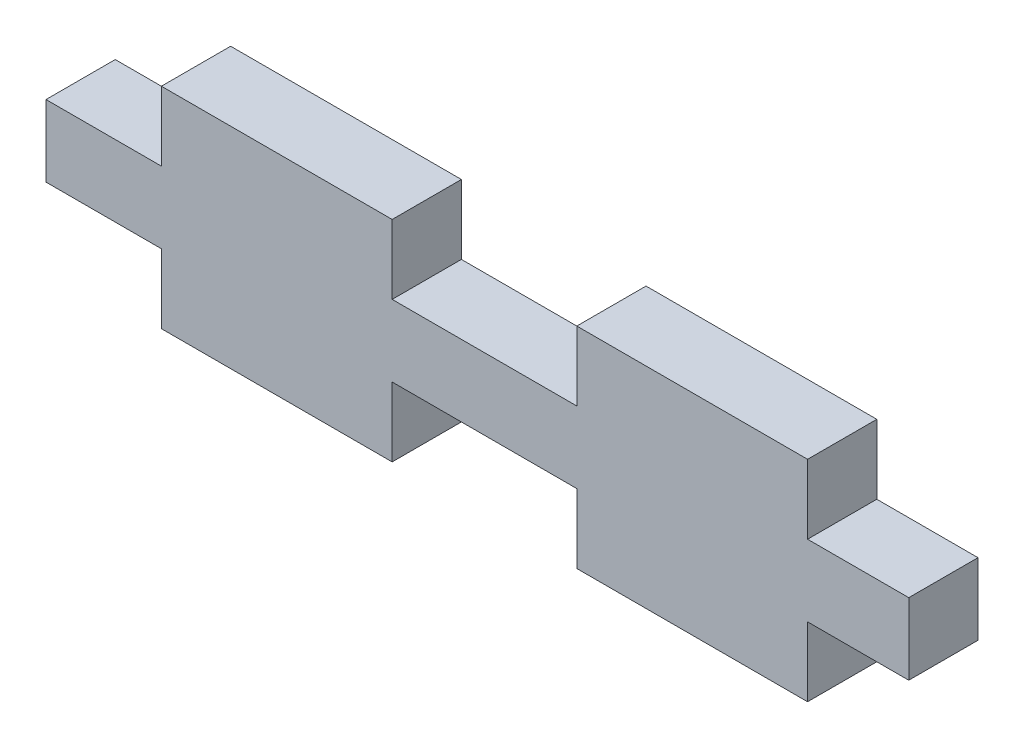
ISO-10303-21;
HEADER;
FILE_DESCRIPTION(('STEP AP214'),'2;1');
FILE_NAME('part.step','',(''),(''),'','','');
FILE_SCHEMA(('AUTOMOTIVE_DESIGN { 1 0 10303 214 1 1 1 1 }'));
ENDSEC;
DATA;
#1=APPLICATION_CONTEXT('core data for automotive mechanical design processes');
#2=APPLICATION_PROTOCOL_DEFINITION('international standard','automotive_design',2000,#1);
#3=PRODUCT_CONTEXT('',#1,'mechanical');
#4=PRODUCT('Part','Part','',(#3));
#5=PRODUCT_RELATED_PRODUCT_CATEGORY('part','',(#4));
#6=PRODUCT_DEFINITION_FORMATION('','',#4);
#7=PRODUCT_DEFINITION_CONTEXT('part definition',#1,'design');
#8=PRODUCT_DEFINITION('design','',#6,#7);
#9=PRODUCT_DEFINITION_SHAPE('','',#8);
#10=(LENGTH_UNIT() NAMED_UNIT(*) SI_UNIT(.MILLI.,.METRE.));
#11=(NAMED_UNIT(*) PLANE_ANGLE_UNIT() SI_UNIT($,.RADIAN.));
#12=(NAMED_UNIT(*) SI_UNIT($,.STERADIAN.) SOLID_ANGLE_UNIT());
#13=UNCERTAINTY_MEASURE_WITH_UNIT(LENGTH_MEASURE(1.E-05),#10,'distance_accuracy_value','');
#14=(GEOMETRIC_REPRESENTATION_CONTEXT(3) GLOBAL_UNCERTAINTY_ASSIGNED_CONTEXT((#13)) GLOBAL_UNIT_ASSIGNED_CONTEXT((#10,
#11,#12)) REPRESENTATION_CONTEXT('',''));
#15=CARTESIAN_POINT('',(0.,0.,0.));
#16=DIRECTION('',(0.,0.,1.));
#17=DIRECTION('',(1.,0.,0.));
#18=AXIS2_PLACEMENT_3D('',#15,#16,#17);
#19=CARTESIAN_POINT('',(-45.3846510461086,3.1,3.));
#20=DIRECTION('',(1.,0.,0.));
#21=DIRECTION('',(0.,0.,-1.));
#22=AXIS2_PLACEMENT_3D('',#19,#20,#21);
#23=PLANE('',#22);
#24=DIRECTION('',(0.,-1.,0.));
#25=VECTOR('',#24,1.);
#26=CARTESIAN_POINT('',(-45.3846510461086,3.1,0.));
#27=LINE('',#26,#25);
#28=CARTESIAN_POINT('',(-45.3846510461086,3.1,0.));
#29=VERTEX_POINT('',#28);
#30=CARTESIAN_POINT('',(-45.3846510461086,0.,0.));
#31=VERTEX_POINT('',#30);
#32=EDGE_CURVE('E201',#29,#31,#27,.T.);
#33=ORIENTED_EDGE('',*,*,#32,.T.);
#34=DIRECTION('',(0.,0.,-1.));
#35=VECTOR('',#34,1.);
#36=CARTESIAN_POINT('',(-45.3846510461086,0.,3.));
#37=LINE('',#36,#35);
#38=CARTESIAN_POINT('',(-45.3846510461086,0.,3.));
#39=VERTEX_POINT('',#38);
#40=EDGE_CURVE('E11',#39,#31,#37,.T.);
#41=ORIENTED_EDGE('',*,*,#40,.F.);
#42=DIRECTION('',(0.,-1.,0.));
#43=VECTOR('',#42,1.);
#44=CARTESIAN_POINT('',(-45.3846510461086,3.1,3.));
#45=LINE('',#44,#43);
#46=CARTESIAN_POINT('',(-45.3846510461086,3.1,3.));
#47=VERTEX_POINT('',#46);
#48=EDGE_CURVE('E239',#47,#39,#45,.T.);
#49=ORIENTED_EDGE('',*,*,#48,.F.);
#50=DIRECTION('',(0.,0.,-1.));
#51=VECTOR('',#50,1.);
#52=CARTESIAN_POINT('',(-45.3846510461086,3.1,3.));
#53=LINE('',#52,#51);
#54=EDGE_CURVE('E197',#47,#29,#53,.T.);
#55=ORIENTED_EDGE('',*,*,#54,.T.);
#56=EDGE_LOOP('',(#33,#41,#49,#55));
#57=FACE_BOUND('',#56,.T.);
#58=ADVANCED_FACE('F33',(#57),#23,.F.);
#59=CARTESIAN_POINT('',(-45.3846510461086,0.,3.));
#60=DIRECTION('',(0.,1.,0.));
#61=DIRECTION('',(0.,0.,1.));
#62=AXIS2_PLACEMENT_3D('',#59,#60,#61);
#63=PLANE('',#62);
#64=DIRECTION('',(1.,0.,0.));
#65=VECTOR('',#64,1.);
#66=CARTESIAN_POINT('',(-45.3846510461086,0.,0.));
#67=LINE('',#66,#65);
#68=CARTESIAN_POINT('',(-40.3846510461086,0.,0.));
#69=VERTEX_POINT('',#68);
#70=EDGE_CURVE('E204',#31,#69,#67,.T.);
#71=ORIENTED_EDGE('',*,*,#70,.T.);
#72=DIRECTION('',(0.,0.,-1.));
#73=VECTOR('',#72,1.);
#74=CARTESIAN_POINT('',(-40.3846510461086,0.,3.));
#75=LINE('',#74,#73);
#76=CARTESIAN_POINT('',(-40.3846510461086,0.,3.));
#77=VERTEX_POINT('',#76);
#78=EDGE_CURVE('E41',#77,#69,#75,.T.);
#79=ORIENTED_EDGE('',*,*,#78,.F.);
#80=DIRECTION('',(1.,0.,0.));
#81=VECTOR('',#80,1.);
#82=CARTESIAN_POINT('',(-45.3846510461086,0.,3.));
#83=LINE('',#82,#81);
#84=EDGE_CURVE('E128',#39,#77,#83,.T.);
#85=ORIENTED_EDGE('',*,*,#84,.F.);
#86=ORIENTED_EDGE('',*,*,#40,.T.);
#87=EDGE_LOOP('',(#71,#79,#85,#86));
#88=FACE_BOUND('',#87,.T.);
#89=ADVANCED_FACE('F357',(#88),#63,.F.);
#90=CARTESIAN_POINT('',(-40.3846510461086,0.,3.));
#91=DIRECTION('',(1.,0.,0.));
#92=DIRECTION('',(0.,0.,-1.));
#93=AXIS2_PLACEMENT_3D('',#90,#91,#92);
#94=PLANE('',#93);
#95=DIRECTION('',(0.,-1.,0.));
#96=VECTOR('',#95,1.);
#97=CARTESIAN_POINT('',(-40.3846510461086,0.,0.));
#98=LINE('',#97,#96);
#99=CARTESIAN_POINT('',(-40.3846510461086,-3.,0.));
#100=VERTEX_POINT('',#99);
#101=EDGE_CURVE('E206',#69,#100,#98,.T.);
#102=ORIENTED_EDGE('',*,*,#101,.T.);
#103=DIRECTION('',(0.,0.,-1.));
#104=VECTOR('',#103,1.);
#105=CARTESIAN_POINT('',(-40.3846510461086,-3.,3.));
#106=LINE('',#105,#104);
#107=CARTESIAN_POINT('',(-40.3846510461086,-3.,3.));
#108=VERTEX_POINT('',#107);
#109=EDGE_CURVE('E282',#108,#100,#106,.T.);
#110=ORIENTED_EDGE('',*,*,#109,.F.);
#111=DIRECTION('',(0.,-1.,0.));
#112=VECTOR('',#111,1.);
#113=CARTESIAN_POINT('',(-40.3846510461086,0.,3.));
#114=LINE('',#113,#112);
#115=EDGE_CURVE('E290',#77,#108,#114,.T.);
#116=ORIENTED_EDGE('',*,*,#115,.F.);
#117=ORIENTED_EDGE('',*,*,#78,.T.);
#118=EDGE_LOOP('',(#102,#110,#116,#117));
#119=FACE_BOUND('',#118,.T.);
#120=ADVANCED_FACE('F288',(#119),#94,.F.);
#121=CARTESIAN_POINT('',(-40.3846510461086,-3.,3.));
#122=DIRECTION('',(0.,1.,0.));
#123=DIRECTION('',(0.,0.,1.));
#124=AXIS2_PLACEMENT_3D('',#121,#122,#123);
#125=PLANE('',#124);
#126=DIRECTION('',(1.,0.,0.));
#127=VECTOR('',#126,1.);
#128=CARTESIAN_POINT('',(-40.3846510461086,-3.,0.));
#129=LINE('',#128,#127);
#130=CARTESIAN_POINT('',(-30.3846510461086,-3.,0.));
#131=VERTEX_POINT('',#130);
#132=EDGE_CURVE('E208',#100,#131,#129,.T.);
#133=ORIENTED_EDGE('',*,*,#132,.T.);
#134=DIRECTION('',(0.,0.,-1.));
#135=VECTOR('',#134,1.);
#136=CARTESIAN_POINT('',(-30.3846510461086,-3.,3.));
#137=LINE('',#136,#135);
#138=CARTESIAN_POINT('',(-30.3846510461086,-3.,3.));
#139=VERTEX_POINT('',#138);
#140=EDGE_CURVE('E279',#139,#131,#137,.T.);
#141=ORIENTED_EDGE('',*,*,#140,.F.);
#142=DIRECTION('',(1.,0.,0.));
#143=VECTOR('',#142,1.);
#144=CARTESIAN_POINT('',(-40.3846510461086,-3.,3.));
#145=LINE('',#144,#143);
#146=EDGE_CURVE('E308',#108,#139,#145,.T.);
#147=ORIENTED_EDGE('',*,*,#146,.F.);
#148=ORIENTED_EDGE('',*,*,#109,.T.);
#149=EDGE_LOOP('',(#133,#141,#147,#148));
#150=FACE_BOUND('',#149,.T.);
#151=ADVANCED_FACE('F299',(#150),#125,.F.);
#152=CARTESIAN_POINT('',(-30.3846510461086,-3.,3.));
#153=DIRECTION('',(-1.,0.,0.));
#154=DIRECTION('',(0.,0.,1.));
#155=AXIS2_PLACEMENT_3D('',#152,#153,#154);
#156=PLANE('',#155);
#157=DIRECTION('',(0.,1.,0.));
#158=VECTOR('',#157,1.);
#159=CARTESIAN_POINT('',(-30.3846510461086,-3.,0.));
#160=LINE('',#159,#158);
#161=CARTESIAN_POINT('',(-30.3846510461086,0.,0.));
#162=VERTEX_POINT('',#161);
#163=EDGE_CURVE('E210',#131,#162,#160,.T.);
#164=ORIENTED_EDGE('',*,*,#163,.T.);
#165=DIRECTION('',(0.,0.,-1.));
#166=VECTOR('',#165,1.);
#167=CARTESIAN_POINT('',(-30.3846510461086,0.,3.));
#168=LINE('',#167,#166);
#169=CARTESIAN_POINT('',(-30.3846510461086,0.,3.));
#170=VERTEX_POINT('',#169);
#171=EDGE_CURVE('E276',#170,#162,#168,.T.);
#172=ORIENTED_EDGE('',*,*,#171,.F.);
#173=DIRECTION('',(0.,1.,0.));
#174=VECTOR('',#173,1.);
#175=CARTESIAN_POINT('',(-30.3846510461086,-3.,3.));
#176=LINE('',#175,#174);
#177=EDGE_CURVE('E305',#139,#170,#176,.T.);
#178=ORIENTED_EDGE('',*,*,#177,.F.);
#179=ORIENTED_EDGE('',*,*,#140,.T.);
#180=EDGE_LOOP('',(#164,#172,#178,#179));
#181=FACE_BOUND('',#180,.T.);
#182=ADVANCED_FACE('F303',(#181),#156,.F.);
#183=CARTESIAN_POINT('',(-30.3846510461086,0.,3.));
#184=DIRECTION('',(0.,1.,0.));
#185=DIRECTION('',(0.,0.,1.));
#186=AXIS2_PLACEMENT_3D('',#183,#184,#185);
#187=PLANE('',#186);
#188=DIRECTION('',(1.,0.,0.));
#189=VECTOR('',#188,1.);
#190=CARTESIAN_POINT('',(-30.3846510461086,0.,0.));
#191=LINE('',#190,#189);
#192=CARTESIAN_POINT('',(-22.3846510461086,0.,0.));
#193=VERTEX_POINT('',#192);
#194=EDGE_CURVE('E212',#162,#193,#191,.T.);
#195=ORIENTED_EDGE('',*,*,#194,.T.);
#196=DIRECTION('',(0.,0.,-1.));
#197=VECTOR('',#196,1.);
#198=CARTESIAN_POINT('',(-22.3846510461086,0.,3.));
#199=LINE('',#198,#197);
#200=CARTESIAN_POINT('',(-22.3846510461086,0.,3.));
#201=VERTEX_POINT('',#200);
#202=EDGE_CURVE('E273',#201,#193,#199,.T.);
#203=ORIENTED_EDGE('',*,*,#202,.F.);
#204=DIRECTION('',(1.,0.,0.));
#205=VECTOR('',#204,1.);
#206=CARTESIAN_POINT('',(-30.3846510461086,0.,3.));
#207=LINE('',#206,#205);
#208=EDGE_CURVE('E307',#170,#201,#207,.T.);
#209=ORIENTED_EDGE('',*,*,#208,.F.);
#210=ORIENTED_EDGE('',*,*,#171,.T.);
#211=EDGE_LOOP('',(#195,#203,#209,#210));
#212=FACE_BOUND('',#211,.T.);
#213=ADVANCED_FACE('F370',(#212),#187,.F.);
#214=CARTESIAN_POINT('',(-22.3846510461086,0.,3.));
#215=DIRECTION('',(1.,0.,0.));
#216=DIRECTION('',(0.,0.,-1.));
#217=AXIS2_PLACEMENT_3D('',#214,#215,#216);
#218=PLANE('',#217);
#219=DIRECTION('',(0.,-1.,0.));
#220=VECTOR('',#219,1.);
#221=CARTESIAN_POINT('',(-22.3846510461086,0.,0.));
#222=LINE('',#221,#220);
#223=CARTESIAN_POINT('',(-22.3846510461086,-3.,0.));
#224=VERTEX_POINT('',#223);
#225=EDGE_CURVE('E214',#193,#224,#222,.T.);
#226=ORIENTED_EDGE('',*,*,#225,.T.);
#227=DIRECTION('',(0.,0.,-1.));
#228=VECTOR('',#227,1.);
#229=CARTESIAN_POINT('',(-22.3846510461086,-3.,3.));
#230=LINE('',#229,#228);
#231=CARTESIAN_POINT('',(-22.3846510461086,-3.,3.));
#232=VERTEX_POINT('',#231);
#233=EDGE_CURVE('E270',#232,#224,#230,.T.);
#234=ORIENTED_EDGE('',*,*,#233,.F.);
#235=DIRECTION('',(0.,-1.,0.));
#236=VECTOR('',#235,1.);
#237=CARTESIAN_POINT('',(-22.3846510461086,0.,3.));
#238=LINE('',#237,#236);
#239=EDGE_CURVE('E310',#201,#232,#238,.T.);
#240=ORIENTED_EDGE('',*,*,#239,.F.);
#241=ORIENTED_EDGE('',*,*,#202,.T.);
#242=EDGE_LOOP('',(#226,#234,#240,#241));
#243=FACE_BOUND('',#242,.T.);
#244=ADVANCED_FACE('F373',(#243),#218,.F.);
#245=CARTESIAN_POINT('',(-22.3846510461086,-3.,3.));
#246=DIRECTION('',(0.,1.,0.));
#247=DIRECTION('',(0.,0.,1.));
#248=AXIS2_PLACEMENT_3D('',#245,#246,#247);
#249=PLANE('',#248);
#250=DIRECTION('',(1.,0.,0.));
#251=VECTOR('',#250,1.);
#252=CARTESIAN_POINT('',(-22.3846510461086,-3.,0.));
#253=LINE('',#252,#251);
#254=CARTESIAN_POINT('',(-12.3846510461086,-3.,0.));
#255=VERTEX_POINT('',#254);
#256=EDGE_CURVE('E216',#224,#255,#253,.T.);
#257=ORIENTED_EDGE('',*,*,#256,.T.);
#258=DIRECTION('',(0.,0.,-1.));
#259=VECTOR('',#258,1.);
#260=CARTESIAN_POINT('',(-12.3846510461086,-3.,3.));
#261=LINE('',#260,#259);
#262=CARTESIAN_POINT('',(-12.3846510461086,-3.,3.));
#263=VERTEX_POINT('',#262);
#264=EDGE_CURVE('E267',#263,#255,#261,.T.);
#265=ORIENTED_EDGE('',*,*,#264,.F.);
#266=DIRECTION('',(1.,0.,0.));
#267=VECTOR('',#266,1.);
#268=CARTESIAN_POINT('',(-22.3846510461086,-3.,3.));
#269=LINE('',#268,#267);
#270=EDGE_CURVE('E316',#232,#263,#269,.T.);
#271=ORIENTED_EDGE('',*,*,#270,.F.);
#272=ORIENTED_EDGE('',*,*,#233,.T.);
#273=EDGE_LOOP('',(#257,#265,#271,#272));
#274=FACE_BOUND('',#273,.T.);
#275=ADVANCED_FACE('F377',(#274),#249,.F.);
#276=CARTESIAN_POINT('',(-12.3846510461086,-3.,3.));
#277=DIRECTION('',(-1.,0.,0.));
#278=DIRECTION('',(0.,0.,1.));
#279=AXIS2_PLACEMENT_3D('',#276,#277,#278);
#280=PLANE('',#279);
#281=DIRECTION('',(0.,1.,0.));
#282=VECTOR('',#281,1.);
#283=CARTESIAN_POINT('',(-12.3846510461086,-3.,0.));
#284=LINE('',#283,#282);
#285=CARTESIAN_POINT('',(-12.3846510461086,0.,0.));
#286=VERTEX_POINT('',#285);
#287=EDGE_CURVE('E218',#255,#286,#284,.T.);
#288=ORIENTED_EDGE('',*,*,#287,.T.);
#289=DIRECTION('',(0.,0.,-1.));
#290=VECTOR('',#289,1.);
#291=CARTESIAN_POINT('',(-12.3846510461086,0.,3.));
#292=LINE('',#291,#290);
#293=CARTESIAN_POINT('',(-12.3846510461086,0.,3.));
#294=VERTEX_POINT('',#293);
#295=EDGE_CURVE('E264',#294,#286,#292,.T.);
#296=ORIENTED_EDGE('',*,*,#295,.F.);
#297=DIRECTION('',(0.,1.,0.));
#298=VECTOR('',#297,1.);
#299=CARTESIAN_POINT('',(-12.3846510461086,-3.,3.));
#300=LINE('',#299,#298);
#301=EDGE_CURVE('E318',#263,#294,#300,.T.);
#302=ORIENTED_EDGE('',*,*,#301,.F.);
#303=ORIENTED_EDGE('',*,*,#264,.T.);
#304=EDGE_LOOP('',(#288,#296,#302,#303));
#305=FACE_BOUND('',#304,.T.);
#306=ADVANCED_FACE('F381',(#305),#280,.F.);
#307=CARTESIAN_POINT('',(-12.3846510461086,0.,3.));
#308=DIRECTION('',(0.,1.,0.));
#309=DIRECTION('',(0.,0.,1.));
#310=AXIS2_PLACEMENT_3D('',#307,#308,#309);
#311=PLANE('',#310);
#312=DIRECTION('',(1.,0.,0.));
#313=VECTOR('',#312,1.);
#314=CARTESIAN_POINT('',(-12.3846510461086,0.,0.));
#315=LINE('',#314,#313);
#316=CARTESIAN_POINT('',(-8.00000000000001,0.,0.));
#317=VERTEX_POINT('',#316);
#318=EDGE_CURVE('E220',#286,#317,#315,.T.);
#319=ORIENTED_EDGE('',*,*,#318,.T.);
#320=DIRECTION('',(0.,0.,-1.));
#321=VECTOR('',#320,1.);
#322=CARTESIAN_POINT('',(-8.00000000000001,0.,3.));
#323=LINE('',#322,#321);
#324=CARTESIAN_POINT('',(-8.00000000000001,0.,3.));
#325=VERTEX_POINT('',#324);
#326=EDGE_CURVE('E261',#325,#317,#323,.T.);
#327=ORIENTED_EDGE('',*,*,#326,.F.);
#328=DIRECTION('',(1.,0.,0.));
#329=VECTOR('',#328,1.);
#330=CARTESIAN_POINT('',(-12.3846510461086,0.,3.));
#331=LINE('',#330,#329);
#332=EDGE_CURVE('E320',#294,#325,#331,.T.);
#333=ORIENTED_EDGE('',*,*,#332,.F.);
#334=ORIENTED_EDGE('',*,*,#295,.T.);
#335=EDGE_LOOP('',(#319,#327,#333,#334));
#336=FACE_BOUND('',#335,.T.);
#337=ADVANCED_FACE('F385',(#336),#311,.F.);
#338=CARTESIAN_POINT('',(-8.00000000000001,0.,3.));
#339=DIRECTION('',(-1.,0.,0.));
#340=DIRECTION('',(0.,0.,1.));
#341=AXIS2_PLACEMENT_3D('',#338,#339,#340);
#342=PLANE('',#341);
#343=DIRECTION('',(0.,1.,0.));
#344=VECTOR('',#343,1.);
#345=CARTESIAN_POINT('',(-8.00000000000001,0.,0.));
#346=LINE('',#345,#344);
#347=CARTESIAN_POINT('',(-8.00000000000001,3.1,0.));
#348=VERTEX_POINT('',#347);
#349=EDGE_CURVE('E222',#317,#348,#346,.T.);
#350=ORIENTED_EDGE('',*,*,#349,.T.);
#351=DIRECTION('',(0.,0.,-1.));
#352=VECTOR('',#351,1.);
#353=CARTESIAN_POINT('',(-8.00000000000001,3.1,3.));
#354=LINE('',#353,#352);
#355=CARTESIAN_POINT('',(-8.00000000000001,3.1,3.));
#356=VERTEX_POINT('',#355);
#357=EDGE_CURVE('E258',#356,#348,#354,.T.);
#358=ORIENTED_EDGE('',*,*,#357,.F.);
#359=DIRECTION('',(0.,1.,0.));
#360=VECTOR('',#359,1.);
#361=CARTESIAN_POINT('',(-8.00000000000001,0.,3.));
#362=LINE('',#361,#360);
#363=EDGE_CURVE('E322',#325,#356,#362,.T.);
#364=ORIENTED_EDGE('',*,*,#363,.F.);
#365=ORIENTED_EDGE('',*,*,#326,.T.);
#366=EDGE_LOOP('',(#350,#358,#364,#365));
#367=FACE_BOUND('',#366,.T.);
#368=ADVANCED_FACE('F389',(#367),#342,.F.);
#369=CARTESIAN_POINT('',(-8.00000000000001,3.1,3.));
#370=DIRECTION('',(0.,-1.,0.));
#371=DIRECTION('',(1.,0.,0.));
#372=AXIS2_PLACEMENT_3D('',#369,#370,#371);
#373=PLANE('',#372);
#374=DIRECTION('',(-1.,0.,0.));
#375=VECTOR('',#374,1.);
#376=CARTESIAN_POINT('',(-8.00000000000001,3.1,0.));
#377=LINE('',#376,#375);
#378=CARTESIAN_POINT('',(-12.3846510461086,3.1,0.));
#379=VERTEX_POINT('',#378);
#380=EDGE_CURVE('E224',#348,#379,#377,.T.);
#381=ORIENTED_EDGE('',*,*,#380,.T.);
#382=DIRECTION('',(0.,0.,-1.));
#383=VECTOR('',#382,1.);
#384=CARTESIAN_POINT('',(-12.3846510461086,3.1,3.));
#385=LINE('',#384,#383);
#386=CARTESIAN_POINT('',(-12.3846510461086,3.1,3.));
#387=VERTEX_POINT('',#386);
#388=EDGE_CURVE('E255',#387,#379,#385,.T.);
#389=ORIENTED_EDGE('',*,*,#388,.F.);
#390=DIRECTION('',(-1.,0.,0.));
#391=VECTOR('',#390,1.);
#392=CARTESIAN_POINT('',(-8.00000000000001,3.1,3.));
#393=LINE('',#392,#391);
#394=EDGE_CURVE('E324',#356,#387,#393,.T.);
#395=ORIENTED_EDGE('',*,*,#394,.F.);
#396=ORIENTED_EDGE('',*,*,#357,.T.);
#397=EDGE_LOOP('',(#381,#389,#395,#396));
#398=FACE_BOUND('',#397,.T.);
#399=ADVANCED_FACE('F393',(#398),#373,.F.);
#400=CARTESIAN_POINT('',(-12.3846510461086,3.1,3.));
#401=DIRECTION('',(-1.,0.,0.));
#402=DIRECTION('',(0.,0.,1.));
#403=AXIS2_PLACEMENT_3D('',#400,#401,#402);
#404=PLANE('',#403);
#405=DIRECTION('',(0.,1.,0.));
#406=VECTOR('',#405,1.);
#407=CARTESIAN_POINT('',(-12.3846510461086,3.1,0.));
#408=LINE('',#407,#406);
#409=CARTESIAN_POINT('',(-12.3846510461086,6.10000000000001,0.));
#410=VERTEX_POINT('',#409);
#411=EDGE_CURVE('E226',#379,#410,#408,.T.);
#412=ORIENTED_EDGE('',*,*,#411,.T.);
#413=DIRECTION('',(0.,0.,-1.));
#414=VECTOR('',#413,1.);
#415=CARTESIAN_POINT('',(-12.3846510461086,6.10000000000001,3.));
#416=LINE('',#415,#414);
#417=CARTESIAN_POINT('',(-12.3846510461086,6.10000000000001,3.));
#418=VERTEX_POINT('',#417);
#419=EDGE_CURVE('E252',#418,#410,#416,.T.);
#420=ORIENTED_EDGE('',*,*,#419,.F.);
#421=DIRECTION('',(0.,1.,0.));
#422=VECTOR('',#421,1.);
#423=CARTESIAN_POINT('',(-12.3846510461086,3.1,3.));
#424=LINE('',#423,#422);
#425=EDGE_CURVE('E326',#387,#418,#424,.T.);
#426=ORIENTED_EDGE('',*,*,#425,.F.);
#427=ORIENTED_EDGE('',*,*,#388,.T.);
#428=EDGE_LOOP('',(#412,#420,#426,#427));
#429=FACE_BOUND('',#428,.T.);
#430=ADVANCED_FACE('F397',(#429),#404,.F.);
#431=CARTESIAN_POINT('',(-12.3846510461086,6.10000000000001,3.));
#432=DIRECTION('',(0.,-1.,0.));
#433=DIRECTION('',(1.,0.,0.));
#434=AXIS2_PLACEMENT_3D('',#431,#432,#433);
#435=PLANE('',#434);
#436=DIRECTION('',(-1.,0.,0.));
#437=VECTOR('',#436,1.);
#438=CARTESIAN_POINT('',(-12.3846510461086,6.10000000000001,0.));
#439=LINE('',#438,#437);
#440=CARTESIAN_POINT('',(-22.3846510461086,6.1,0.));
#441=VERTEX_POINT('',#440);
#442=EDGE_CURVE('E228',#410,#441,#439,.T.);
#443=ORIENTED_EDGE('',*,*,#442,.T.);
#444=DIRECTION('',(0.,0.,-1.));
#445=VECTOR('',#444,1.);
#446=CARTESIAN_POINT('',(-22.3846510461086,6.1,3.));
#447=LINE('',#446,#445);
#448=CARTESIAN_POINT('',(-22.3846510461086,6.1,3.));
#449=VERTEX_POINT('',#448);
#450=EDGE_CURVE('E249',#449,#441,#447,.T.);
#451=ORIENTED_EDGE('',*,*,#450,.F.);
#452=DIRECTION('',(-1.,0.,0.));
#453=VECTOR('',#452,1.);
#454=CARTESIAN_POINT('',(-12.3846510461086,6.10000000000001,3.));
#455=LINE('',#454,#453);
#456=EDGE_CURVE('E328',#418,#449,#455,.T.);
#457=ORIENTED_EDGE('',*,*,#456,.F.);
#458=ORIENTED_EDGE('',*,*,#419,.T.);
#459=EDGE_LOOP('',(#443,#451,#457,#458));
#460=FACE_BOUND('',#459,.T.);
#461=ADVANCED_FACE('F401',(#460),#435,.F.);
#462=CARTESIAN_POINT('',(-22.3846510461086,6.1,3.));
#463=DIRECTION('',(1.,0.,0.));
#464=DIRECTION('',(0.,0.,-1.));
#465=AXIS2_PLACEMENT_3D('',#462,#463,#464);
#466=PLANE('',#465);
#467=DIRECTION('',(0.,-1.,0.));
#468=VECTOR('',#467,1.);
#469=CARTESIAN_POINT('',(-22.3846510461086,6.1,0.));
#470=LINE('',#469,#468);
#471=CARTESIAN_POINT('',(-22.3846510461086,3.1,0.));
#472=VERTEX_POINT('',#471);
#473=EDGE_CURVE('E230',#441,#472,#470,.T.);
#474=ORIENTED_EDGE('',*,*,#473,.T.);
#475=DIRECTION('',(0.,0.,-1.));
#476=VECTOR('',#475,1.);
#477=CARTESIAN_POINT('',(-22.3846510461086,3.1,3.));
#478=LINE('',#477,#476);
#479=CARTESIAN_POINT('',(-22.3846510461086,3.1,3.));
#480=VERTEX_POINT('',#479);
#481=EDGE_CURVE('E246',#480,#472,#478,.T.);
#482=ORIENTED_EDGE('',*,*,#481,.F.);
#483=DIRECTION('',(0.,-1.,0.));
#484=VECTOR('',#483,1.);
#485=CARTESIAN_POINT('',(-22.3846510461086,6.1,3.));
#486=LINE('',#485,#484);
#487=EDGE_CURVE('E330',#449,#480,#486,.T.);
#488=ORIENTED_EDGE('',*,*,#487,.F.);
#489=ORIENTED_EDGE('',*,*,#450,.T.);
#490=EDGE_LOOP('',(#474,#482,#488,#489));
#491=FACE_BOUND('',#490,.T.);
#492=ADVANCED_FACE('F405',(#491),#466,.F.);
#493=CARTESIAN_POINT('',(-22.3846510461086,3.1,3.));
#494=DIRECTION('',(0.,-1.,0.));
#495=DIRECTION('',(1.,0.,0.));
#496=AXIS2_PLACEMENT_3D('',#493,#494,#495);
#497=PLANE('',#496);
#498=DIRECTION('',(-1.,0.,0.));
#499=VECTOR('',#498,1.);
#500=CARTESIAN_POINT('',(-22.3846510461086,3.1,0.));
#501=LINE('',#500,#499);
#502=CARTESIAN_POINT('',(-30.3846510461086,3.1,0.));
#503=VERTEX_POINT('',#502);
#504=EDGE_CURVE('E232',#472,#503,#501,.T.);
#505=ORIENTED_EDGE('',*,*,#504,.T.);
#506=DIRECTION('',(0.,0.,-1.));
#507=VECTOR('',#506,1.);
#508=CARTESIAN_POINT('',(-30.3846510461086,3.1,3.));
#509=LINE('',#508,#507);
#510=CARTESIAN_POINT('',(-30.3846510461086,3.1,3.));
#511=VERTEX_POINT('',#510);
#512=EDGE_CURVE('E243',#511,#503,#509,.T.);
#513=ORIENTED_EDGE('',*,*,#512,.F.);
#514=DIRECTION('',(-1.,0.,0.));
#515=VECTOR('',#514,1.);
#516=CARTESIAN_POINT('',(-22.3846510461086,3.1,3.));
#517=LINE('',#516,#515);
#518=EDGE_CURVE('E332',#480,#511,#517,.T.);
#519=ORIENTED_EDGE('',*,*,#518,.F.);
#520=ORIENTED_EDGE('',*,*,#481,.T.);
#521=EDGE_LOOP('',(#505,#513,#519,#520));
#522=FACE_BOUND('',#521,.T.);
#523=ADVANCED_FACE('F338',(#522),#497,.F.);
#524=CARTESIAN_POINT('',(-30.3846510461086,3.1,3.));
#525=DIRECTION('',(-1.,0.,0.));
#526=DIRECTION('',(0.,0.,1.));
#527=AXIS2_PLACEMENT_3D('',#524,#525,#526);
#528=PLANE('',#527);
#529=DIRECTION('',(0.,1.,0.));
#530=VECTOR('',#529,1.);
#531=CARTESIAN_POINT('',(-30.3846510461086,3.1,0.));
#532=LINE('',#531,#530);
#533=CARTESIAN_POINT('',(-30.3846510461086,6.1,0.));
#534=VERTEX_POINT('',#533);
#535=EDGE_CURVE('E234',#503,#534,#532,.T.);
#536=ORIENTED_EDGE('',*,*,#535,.T.);
#537=DIRECTION('',(0.,0.,-1.));
#538=VECTOR('',#537,1.);
#539=CARTESIAN_POINT('',(-30.3846510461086,6.1,3.));
#540=LINE('',#539,#538);
#541=CARTESIAN_POINT('',(-30.3846510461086,6.1,3.));
#542=VERTEX_POINT('',#541);
#543=EDGE_CURVE('E192',#542,#534,#540,.T.);
#544=ORIENTED_EDGE('',*,*,#543,.F.);
#545=DIRECTION('',(0.,1.,0.));
#546=VECTOR('',#545,1.);
#547=CARTESIAN_POINT('',(-30.3846510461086,3.1,3.));
#548=LINE('',#547,#546);
#549=EDGE_CURVE('E183',#511,#542,#548,.T.);
#550=ORIENTED_EDGE('',*,*,#549,.F.);
#551=ORIENTED_EDGE('',*,*,#512,.T.);
#552=EDGE_LOOP('',(#536,#544,#550,#551));
#553=FACE_BOUND('',#552,.T.);
#554=ADVANCED_FACE('F342',(#553),#528,.F.);
#555=CARTESIAN_POINT('',(-30.3846510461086,6.1,3.));
#556=DIRECTION('',(0.,-1.,0.));
#557=DIRECTION('',(1.,0.,0.));
#558=AXIS2_PLACEMENT_3D('',#555,#556,#557);
#559=PLANE('',#558);
#560=DIRECTION('',(-1.,0.,0.));
#561=VECTOR('',#560,1.);
#562=CARTESIAN_POINT('',(-30.3846510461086,6.1,0.));
#563=LINE('',#562,#561);
#564=CARTESIAN_POINT('',(-40.3846510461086,6.1,0.));
#565=VERTEX_POINT('',#564);
#566=EDGE_CURVE('E191',#534,#565,#563,.T.);
#567=ORIENTED_EDGE('',*,*,#566,.T.);
#568=DIRECTION('',(0.,0.,-1.));
#569=VECTOR('',#568,1.);
#570=CARTESIAN_POINT('',(-40.3846510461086,6.1,3.));
#571=LINE('',#570,#569);
#572=CARTESIAN_POINT('',(-40.3846510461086,6.1,3.));
#573=VERTEX_POINT('',#572);
#574=EDGE_CURVE('E188',#573,#565,#571,.T.);
#575=ORIENTED_EDGE('',*,*,#574,.F.);
#576=DIRECTION('',(-1.,0.,0.));
#577=VECTOR('',#576,1.);
#578=CARTESIAN_POINT('',(-30.3846510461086,6.1,3.));
#579=LINE('',#578,#577);
#580=EDGE_CURVE('E177',#542,#573,#579,.T.);
#581=ORIENTED_EDGE('',*,*,#580,.F.);
#582=ORIENTED_EDGE('',*,*,#543,.T.);
#583=EDGE_LOOP('',(#567,#575,#581,#582));
#584=FACE_BOUND('',#583,.T.);
#585=ADVANCED_FACE('F189',(#584),#559,.F.);
#586=CARTESIAN_POINT('',(-40.3846510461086,6.1,3.));
#587=DIRECTION('',(1.,0.,0.));
#588=DIRECTION('',(0.,0.,-1.));
#589=AXIS2_PLACEMENT_3D('',#586,#587,#588);
#590=PLANE('',#589);
#591=DIRECTION('',(0.,-1.,0.));
#592=VECTOR('',#591,1.);
#593=CARTESIAN_POINT('',(-40.3846510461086,6.1,0.));
#594=LINE('',#593,#592);
#595=CARTESIAN_POINT('',(-40.3846510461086,3.1,0.));
#596=VERTEX_POINT('',#595);
#597=EDGE_CURVE('E114',#565,#596,#594,.T.);
#598=ORIENTED_EDGE('',*,*,#597,.T.);
#599=DIRECTION('',(0.,0.,-1.));
#600=VECTOR('',#599,1.);
#601=CARTESIAN_POINT('',(-40.3846510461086,3.1,3.));
#602=LINE('',#601,#600);
#603=CARTESIAN_POINT('',(-40.3846510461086,3.1,3.));
#604=VERTEX_POINT('',#603);
#605=EDGE_CURVE('E193',#604,#596,#602,.T.);
#606=ORIENTED_EDGE('',*,*,#605,.F.);
#607=DIRECTION('',(0.,-1.,0.));
#608=VECTOR('',#607,1.);
#609=CARTESIAN_POINT('',(-40.3846510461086,6.1,3.));
#610=LINE('',#609,#608);
#611=EDGE_CURVE('E181',#573,#604,#610,.T.);
#612=ORIENTED_EDGE('',*,*,#611,.F.);
#613=ORIENTED_EDGE('',*,*,#574,.T.);
#614=EDGE_LOOP('',(#598,#606,#612,#613));
#615=FACE_BOUND('',#614,.T.);
#616=ADVANCED_FACE('F195',(#615),#590,.F.);
#617=CARTESIAN_POINT('',(-40.3846510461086,3.1,3.));
#618=DIRECTION('',(0.,-1.,0.));
#619=DIRECTION('',(1.,0.,0.));
#620=AXIS2_PLACEMENT_3D('',#617,#618,#619);
#621=PLANE('',#620);
#622=DIRECTION('',(-1.,0.,0.));
#623=VECTOR('',#622,1.);
#624=CARTESIAN_POINT('',(-40.3846510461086,3.1,0.));
#625=LINE('',#624,#623);
#626=EDGE_CURVE('E120',#596,#29,#625,.T.);
#627=ORIENTED_EDGE('',*,*,#626,.T.);
#628=ORIENTED_EDGE('',*,*,#54,.F.);
#629=DIRECTION('',(-1.,0.,0.));
#630=VECTOR('',#629,1.);
#631=CARTESIAN_POINT('',(-40.3846510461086,3.1,3.));
#632=LINE('',#631,#630);
#633=EDGE_CURVE('E49',#604,#47,#632,.T.);
#634=ORIENTED_EDGE('',*,*,#633,.F.);
#635=ORIENTED_EDGE('',*,*,#605,.T.);
#636=EDGE_LOOP('',(#627,#628,#634,#635));
#637=FACE_BOUND('',#636,.T.);
#638=ADVANCED_FACE('F346',(#637),#621,.F.);
#639=CARTESIAN_POINT('',(0.,0.,3.));
#640=DIRECTION('',(0.,0.,1.));
#641=DIRECTION('',(1.,0.,0.));
#642=AXIS2_PLACEMENT_3D('',#639,#640,#641);
#643=PLANE('',#642);
#644=ORIENTED_EDGE('',*,*,#48,.T.);
#645=ORIENTED_EDGE('',*,*,#84,.T.);
#646=ORIENTED_EDGE('',*,*,#115,.T.);
#647=ORIENTED_EDGE('',*,*,#146,.T.);
#648=ORIENTED_EDGE('',*,*,#177,.T.);
#649=ORIENTED_EDGE('',*,*,#208,.T.);
#650=ORIENTED_EDGE('',*,*,#239,.T.);
#651=ORIENTED_EDGE('',*,*,#270,.T.);
#652=ORIENTED_EDGE('',*,*,#301,.T.);
#653=ORIENTED_EDGE('',*,*,#332,.T.);
#654=ORIENTED_EDGE('',*,*,#363,.T.);
#655=ORIENTED_EDGE('',*,*,#394,.T.);
#656=ORIENTED_EDGE('',*,*,#425,.T.);
#657=ORIENTED_EDGE('',*,*,#456,.T.);
#658=ORIENTED_EDGE('',*,*,#487,.T.);
#659=ORIENTED_EDGE('',*,*,#518,.T.);
#660=ORIENTED_EDGE('',*,*,#549,.T.);
#661=ORIENTED_EDGE('',*,*,#580,.T.);
#662=ORIENTED_EDGE('',*,*,#611,.T.);
#663=ORIENTED_EDGE('',*,*,#633,.T.);
#664=EDGE_LOOP('',(#644,#645,#646,#647,#648,#649,#650,#651,#652,#653,#654,#655,#656,#657,#658,
#659,#660,#661,#662,#663));
#665=FACE_BOUND('',#664,.T.);
#666=ADVANCED_FACE('F179',(#665),#643,.T.);
#667=CARTESIAN_POINT('',(0.,0.,0.));
#668=DIRECTION('',(0.,0.,1.));
#669=DIRECTION('',(1.,0.,0.));
#670=AXIS2_PLACEMENT_3D('',#667,#668,#669);
#671=PLANE('',#670);
#672=ORIENTED_EDGE('',*,*,#32,.F.);
#673=ORIENTED_EDGE('',*,*,#626,.F.);
#674=ORIENTED_EDGE('',*,*,#597,.F.);
#675=ORIENTED_EDGE('',*,*,#566,.F.);
#676=ORIENTED_EDGE('',*,*,#535,.F.);
#677=ORIENTED_EDGE('',*,*,#504,.F.);
#678=ORIENTED_EDGE('',*,*,#473,.F.);
#679=ORIENTED_EDGE('',*,*,#442,.F.);
#680=ORIENTED_EDGE('',*,*,#411,.F.);
#681=ORIENTED_EDGE('',*,*,#380,.F.);
#682=ORIENTED_EDGE('',*,*,#349,.F.);
#683=ORIENTED_EDGE('',*,*,#318,.F.);
#684=ORIENTED_EDGE('',*,*,#287,.F.);
#685=ORIENTED_EDGE('',*,*,#256,.F.);
#686=ORIENTED_EDGE('',*,*,#225,.F.);
#687=ORIENTED_EDGE('',*,*,#194,.F.);
#688=ORIENTED_EDGE('',*,*,#163,.F.);
#689=ORIENTED_EDGE('',*,*,#132,.F.);
#690=ORIENTED_EDGE('',*,*,#101,.F.);
#691=ORIENTED_EDGE('',*,*,#70,.F.);
#692=EDGE_LOOP('',(#672,#673,#674,#675,#676,#677,#678,#679,#680,#681,#682,#683,#684,#685,#686,
#687,#688,#689,#690,#691));
#693=FACE_BOUND('',#692,.T.);
#694=ADVANCED_FACE('F294',(#693),#671,.F.);
#695=CLOSED_SHELL('',(#58,#89,#120,#151,#182,#213,#244,#275,#306,#337,#368,#399,#430,#461,#492,
#523,#554,#585,#616,#638,#666,#694));
#696=MANIFOLD_SOLID_BREP('B2',#695);
#697=ADVANCED_BREP_SHAPE_REPRESENTATION('',(#18,#696),#14);
#698=SHAPE_DEFINITION_REPRESENTATION(#9,#697);
ENDSEC;
END-ISO-10303-21;
